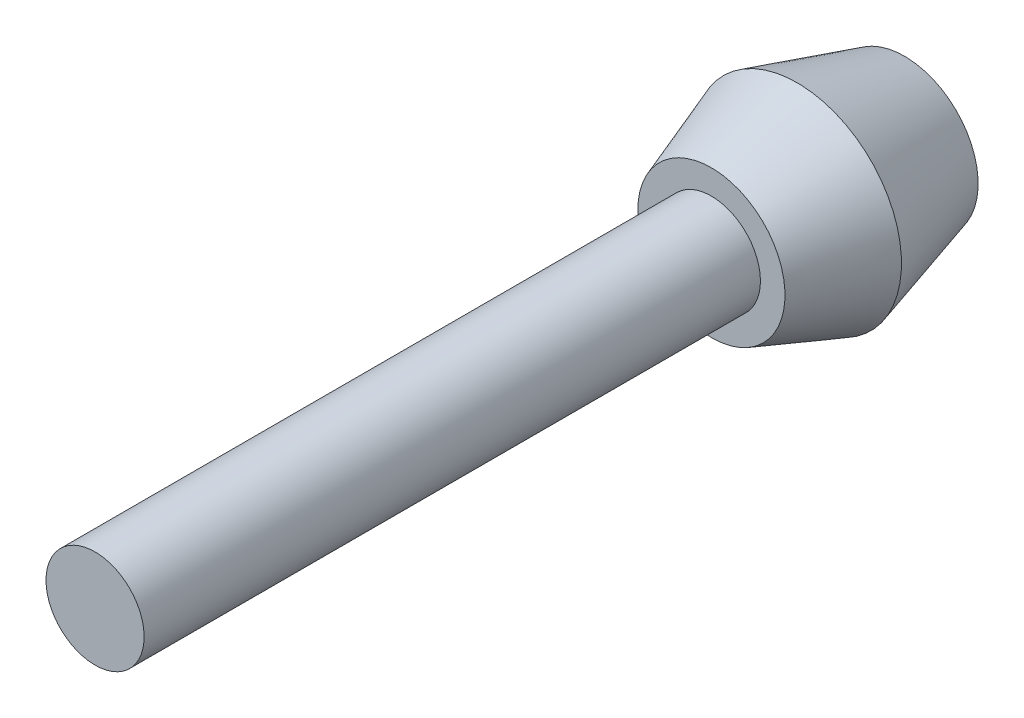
ISO-10303-21;
HEADER;
FILE_DESCRIPTION(('STEP AP214'),'2;1');
FILE_NAME('part.step','',(''),(''),'','','');
FILE_SCHEMA(('AUTOMOTIVE_DESIGN { 1 0 10303 214 1 1 1 1 }'));
ENDSEC;
DATA;
#1=APPLICATION_CONTEXT('core data for automotive mechanical design processes');
#2=APPLICATION_PROTOCOL_DEFINITION('international standard','automotive_design',2000,#1);
#3=PRODUCT_CONTEXT('',#1,'mechanical');
#4=PRODUCT('Part','Part','',(#3));
#5=PRODUCT_RELATED_PRODUCT_CATEGORY('part','',(#4));
#6=PRODUCT_DEFINITION_FORMATION('','',#4);
#7=PRODUCT_DEFINITION_CONTEXT('part definition',#1,'design');
#8=PRODUCT_DEFINITION('design','',#6,#7);
#9=PRODUCT_DEFINITION_SHAPE('','',#8);
#10=(LENGTH_UNIT() NAMED_UNIT(*) SI_UNIT(.MILLI.,.METRE.));
#11=(NAMED_UNIT(*) PLANE_ANGLE_UNIT() SI_UNIT($,.RADIAN.));
#12=(NAMED_UNIT(*) SI_UNIT($,.STERADIAN.) SOLID_ANGLE_UNIT());
#13=UNCERTAINTY_MEASURE_WITH_UNIT(LENGTH_MEASURE(1.E-05),#10,'distance_accuracy_value','');
#14=(GEOMETRIC_REPRESENTATION_CONTEXT(3) GLOBAL_UNCERTAINTY_ASSIGNED_CONTEXT((#13)) GLOBAL_UNIT_ASSIGNED_CONTEXT((#10,
#11,#12)) REPRESENTATION_CONTEXT('',''));
#15=CARTESIAN_POINT('',(0.,0.,0.));
#16=DIRECTION('',(0.,0.,1.));
#17=DIRECTION('',(1.,0.,0.));
#18=AXIS2_PLACEMENT_3D('',#15,#16,#17);
#19=CARTESIAN_POINT('',(0.,0.,0.));
#20=DIRECTION('',(0.,0.,-1.));
#21=DIRECTION('',(0.379653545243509,0.92512874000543,0.));
#22=AXIS2_PLACEMENT_3D('',#19,#20,#21);
#23=PLANE('',#22);
#24=CARTESIAN_POINT('',(0.,0.,0.));
#25=DIRECTION('',(0.,0.,-1.));
#26=DIRECTION('',(-1.,0.,0.));
#27=AXIS2_PLACEMENT_3D('',#24,#25,#26);
#28=CIRCLE('',#27,6.00000000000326);
#29=CARTESIAN_POINT('',(-6.00000000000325,0.,0.));
#30=VERTEX_POINT('',#29);
#31=EDGE_CURVE('E30',#30,#30,#28,.F.);
#32=ORIENTED_EDGE('',*,*,#31,.F.);
#33=EDGE_LOOP('',(#32));
#34=FACE_BOUND('',#33,.T.);
#35=ADVANCED_FACE('F12',(#34),#23,.T.);
#36=CARTESIAN_POINT('',(0.,0.,8.5956478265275));
#37=DIRECTION('',(0.,0.,1.));
#38=DIRECTION('',(-0.379653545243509,-0.92512874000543,0.));
#39=AXIS2_PLACEMENT_3D('',#36,#37,#38);
#40=CONICAL_SURFACE('',#39,8.45589937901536,0.278299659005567);
#41=ORIENTED_EDGE('',*,*,#31,.T.);
#42=EDGE_LOOP('',(#41));
#43=FACE_BOUND('',#42,.T.);
#44=CARTESIAN_POINT('',(0.,0.,8.75000000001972));
#45=DIRECTION('',(0.,0.,-1.));
#46=DIRECTION('',(-1.,0.,0.));
#47=AXIS2_PLACEMENT_3D('',#44,#45,#46);
#48=CIRCLE('',#47,8.50000000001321);
#49=CARTESIAN_POINT('',(-8.5000000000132,0.,8.75000000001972));
#50=VERTEX_POINT('',#49);
#51=EDGE_CURVE('E19',#50,#50,#48,.T.);
#52=ORIENTED_EDGE('',*,*,#51,.T.);
#53=EDGE_LOOP('',(#52));
#54=FACE_BOUND('',#53,.T.);
#55=ADVANCED_FACE('F51',(#43,#54),#40,.T.);
#56=CARTESIAN_POINT('',(0.,0.,8.90117658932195));
#57=DIRECTION('',(0.,0.,-1.));
#58=DIRECTION('',(0.379653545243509,0.92512874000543,0.));
#59=AXIS2_PLACEMENT_3D('',#56,#57,#58);
#60=CONICAL_SURFACE('',#59,8.44600836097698,0.343023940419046);
#61=CARTESIAN_POINT('',(0.,0.,15.75));
#62=DIRECTION('',(0.,0.,-1.));
#63=DIRECTION('',(-1.,0.,0.));
#64=AXIS2_PLACEMENT_3D('',#61,#62,#63);
#65=CIRCLE('',#64,6.00000000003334);
#66=CARTESIAN_POINT('',(-6.00000000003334,0.,15.75));
#67=VERTEX_POINT('',#66);
#68=EDGE_CURVE('E8',#67,#67,#65,.F.);
#69=ORIENTED_EDGE('',*,*,#68,.F.);
#70=EDGE_LOOP('',(#69));
#71=FACE_BOUND('',#70,.T.);
#72=ORIENTED_EDGE('',*,*,#51,.F.);
#73=EDGE_LOOP('',(#72));
#74=FACE_BOUND('',#73,.T.);
#75=ADVANCED_FACE('F14',(#71,#74),#60,.T.);
#76=CARTESIAN_POINT('',(0.,0.,66.));
#77=DIRECTION('',(0.,0.,-1.));
#78=DIRECTION('',(0.481271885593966,0.876571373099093,0.));
#79=AXIS2_PLACEMENT_3D('',#76,#77,#78);
#80=PLANE('',#79);
#81=CARTESIAN_POINT('',(0.,0.,66.));
#82=DIRECTION('',(0.,0.,-1.));
#83=DIRECTION('',(-1.,0.,0.));
#84=AXIS2_PLACEMENT_3D('',#81,#82,#83);
#85=CIRCLE('',#84,4.);
#86=CARTESIAN_POINT('',(-4.00000000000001,0.,66.));
#87=VERTEX_POINT('',#86);
#88=EDGE_CURVE('E23',#87,#87,#85,.T.);
#89=ORIENTED_EDGE('',*,*,#88,.F.);
#90=EDGE_LOOP('',(#89));
#91=FACE_BOUND('',#90,.T.);
#92=ADVANCED_FACE('F47',(#91),#80,.F.);
#93=CARTESIAN_POINT('',(0.,0.,2.75));
#94=DIRECTION('',(0.,0.,1.));
#95=DIRECTION('',(-0.481271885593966,-0.876571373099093,0.));
#96=AXIS2_PLACEMENT_3D('',#93,#94,#95);
#97=CYLINDRICAL_SURFACE('',#96,4.);
#98=CARTESIAN_POINT('',(0.,0.,15.75));
#99=DIRECTION('',(0.,0.,1.));
#100=DIRECTION('',(-0.379653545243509,-0.92512874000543,0.));
#101=AXIS2_PLACEMENT_3D('',#98,#99,#100);
#102=CIRCLE('',#101,4.);
#103=CARTESIAN_POINT('',(-1.51861418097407,-3.70051496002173,15.75));
#104=VERTEX_POINT('',#103);
#105=EDGE_CURVE('E27',#104,#104,#102,.T.);
#106=ORIENTED_EDGE('',*,*,#105,.T.);
#107=EDGE_LOOP('',(#106));
#108=FACE_BOUND('',#107,.T.);
#109=ORIENTED_EDGE('',*,*,#88,.T.);
#110=EDGE_LOOP('',(#109));
#111=FACE_BOUND('',#110,.T.);
#112=ADVANCED_FACE('F36',(#108,#111),#97,.T.);
#113=CARTESIAN_POINT('',(0.,0.,15.75));
#114=DIRECTION('',(0.,0.,-1.));
#115=DIRECTION('',(0.379653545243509,0.92512874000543,0.));
#116=AXIS2_PLACEMENT_3D('',#113,#114,#115);
#117=PLANE('',#116);
#118=ORIENTED_EDGE('',*,*,#105,.F.);
#119=EDGE_LOOP('',(#118));
#120=FACE_BOUND('',#119,.T.);
#121=ORIENTED_EDGE('',*,*,#68,.T.);
#122=EDGE_LOOP('',(#121));
#123=FACE_BOUND('',#122,.T.);
#124=ADVANCED_FACE('F39',(#120,#123),#117,.F.);
#125=CLOSED_SHELL('',(#35,#55,#75,#92,#112,#124));
#126=MANIFOLD_SOLID_BREP('B1',#125);
#127=ADVANCED_BREP_SHAPE_REPRESENTATION('',(#18,#126),#14);
#128=SHAPE_DEFINITION_REPRESENTATION(#9,#127);
ENDSEC;
END-ISO-10303-21;
